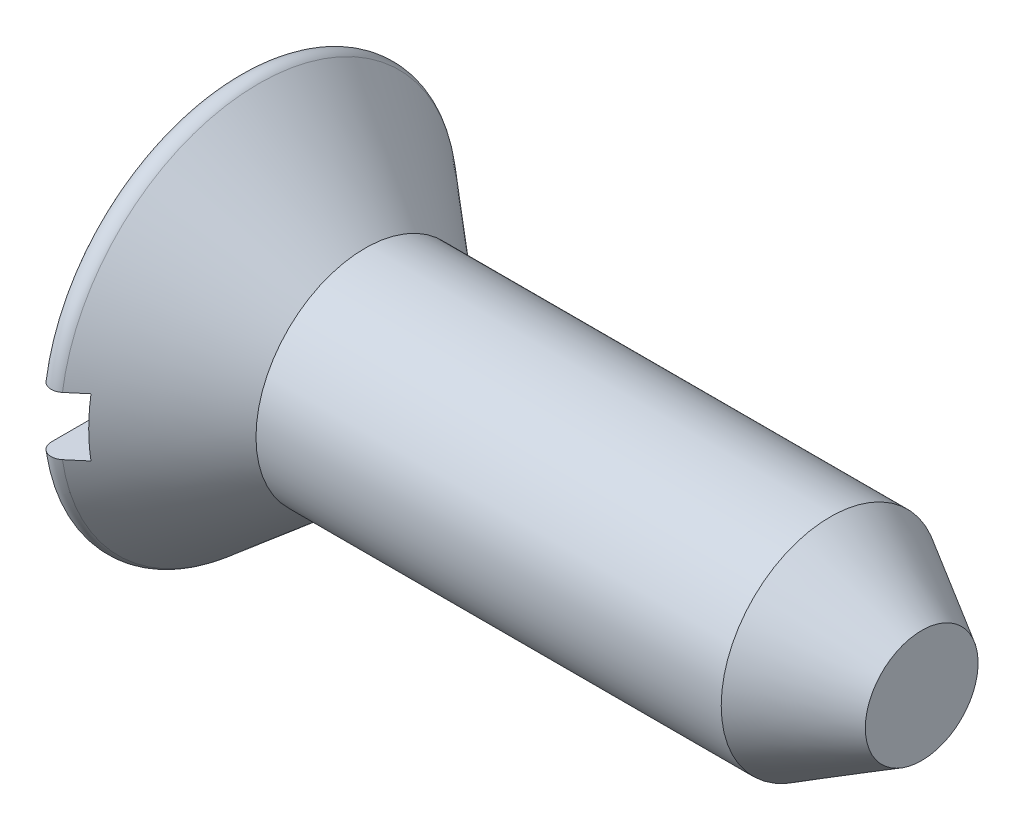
from build123d import *

# Parameters (mm, degrees)
SLOT_CUT_EXTRUDE1_DEPTH      = 6.172756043
SLOT_CUT_EXTRUDE1_DEPTH_BACK = 6.172756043
SKETCH2_W                    = 0.254
SKETCH2_H                    = 0.4064


with BuildPart() as part:
    # Sketch1 → base-Revolve (revolve)
    with BuildSketch(Plane.XY, mode=Mode.PRIVATE) as base_revolve_sk:
        with BuildLine():
            Line((0, 0), (0, 1.317312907))
            ThreePointArc((0, 1.317312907), (0.051329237, 1.397883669), (0.146043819, 1.385414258))
            Line((0.146043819, 1.385414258), (0.889, 0.762))
            Line((0.889, 0.762), (4.7752, 0.762))
            Line((4.7752, 0.762), (4.7752, 0))
            Line((4.7752, 0), (0, 0))
        make_face()
    revolve(base_revolve_sk.sketch.rotate(Axis((0, 0, 0), (1, 0, 0)), 90), axis=Axis((0, 0, 0), (1, 0, 0)))

    # Sketch2 → slot_Cut-Extrude1 (cut, two sides: drawn at the far end of the back side and taken through both)
    with BuildSketch(Plane.XY.offset(-SLOT_CUT_EXTRUDE1_DEPTH_BACK)):
        with Locations((0.127, 0)):
            Rectangle(SKETCH2_W, SKETCH2_H)
    extrude(amount=SLOT_CUT_EXTRUDE1_DEPTH + SLOT_CUT_EXTRUDE1_DEPTH_BACK, mode=Mode.SUBTRACT)

    # Sketch8 → point_Cut-Revolve1 (revolve, cut)
    with BuildSketch(Plane.XY, mode=Mode.PRIVATE) as point_cut_revolve1_sk:
        Polygon((4.7752, 0), (5.2832, 0), (5.2832, 1.27), (4.137285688, 1.27), (4.137285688, 0.762), (4.7752, 0.3937), align=None)
    revolve(point_cut_revolve1_sk.sketch.rotate(Axis((0, 0, 0), (1, 0, 0)), 90), axis=Axis((0, 0, 0), (1, 0, 0)), mode=Mode.SUBTRACT)


solid = part.part
